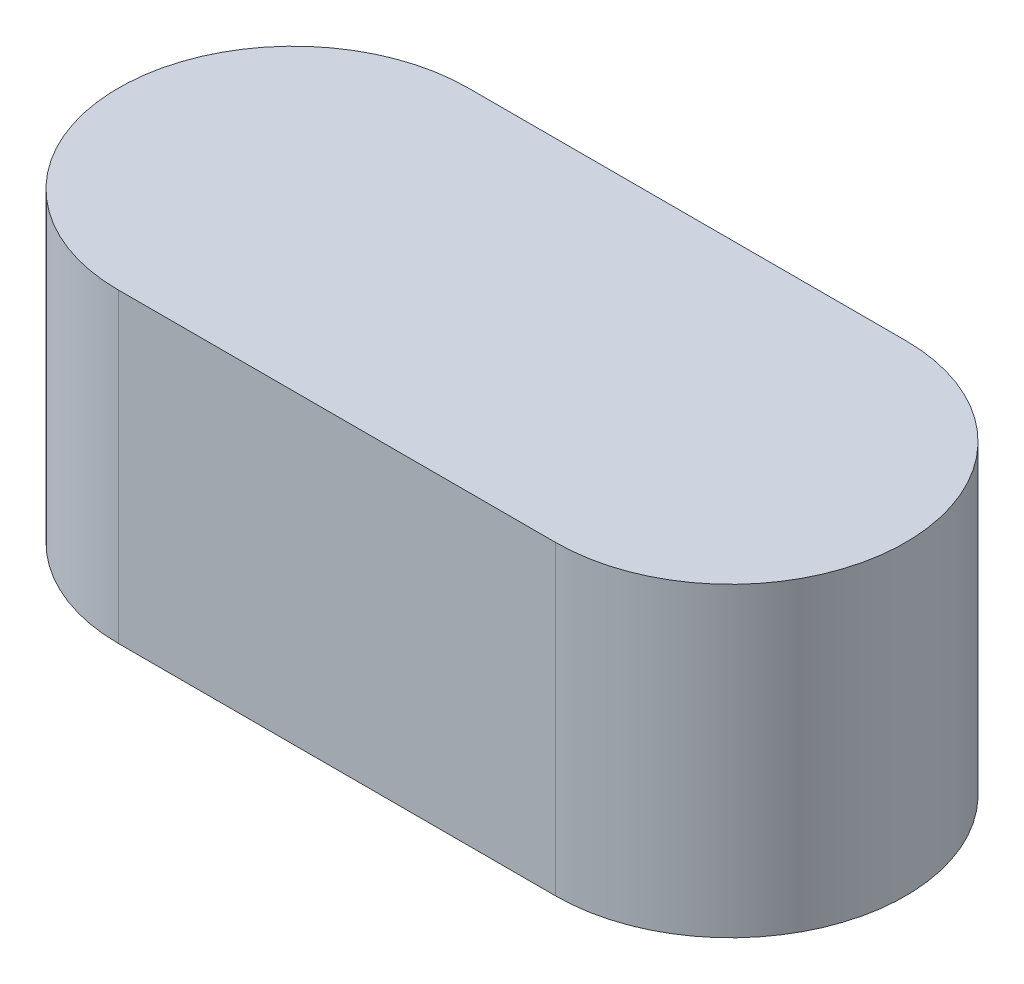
from build123d import *

# Parameters (mm, degrees)
BASE_EXTRUSION_DEPTH = 7


with BuildPart() as part:
    # Esquisse1 → Base-Extrusion (new body)
    with BuildSketch(Plane(origin=(0, 0, 0), x_dir=(0, 0, -1), z_dir=(0, -1, 0))):
        with BuildLine():
            Line((4, 0), (4, -10))
            ThreePointArc((4, -10), (0, -14), (-4, -10))
            Line((-4, -10), (-4, 0))
            ThreePointArc((-4, 0), (0, 4), (4, 0))
        make_face()
    extrude(amount=BASE_EXTRUSION_DEPTH)


solid = part.part
